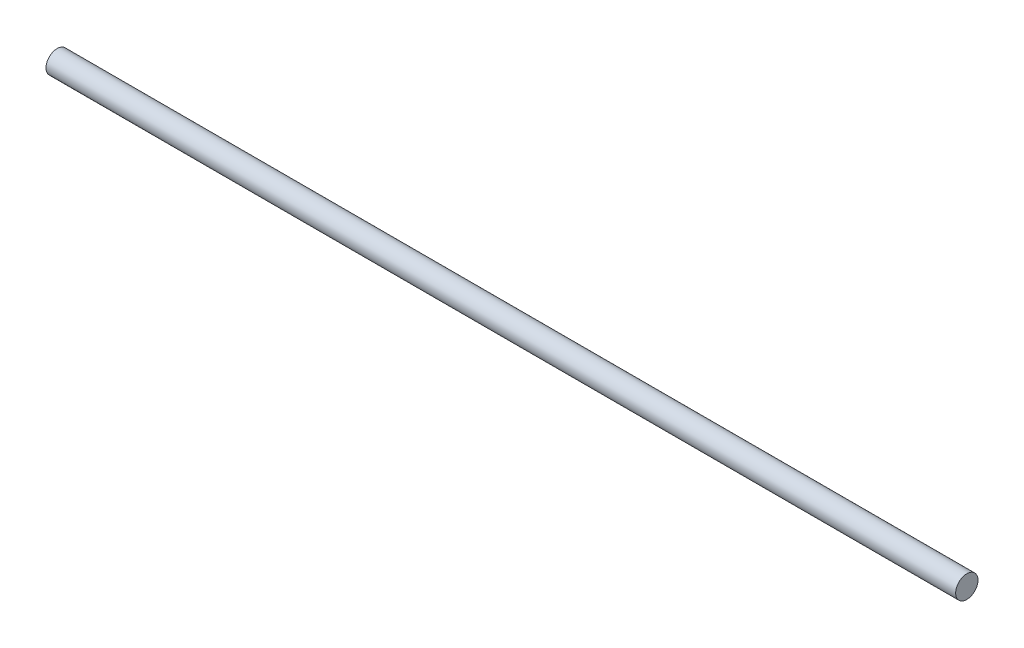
ISO-10303-21;
HEADER;
FILE_DESCRIPTION(('STEP AP214'),'2;1');
FILE_NAME('part.step','',(''),(''),'','','');
FILE_SCHEMA(('AUTOMOTIVE_DESIGN { 1 0 10303 214 1 1 1 1 }'));
ENDSEC;
DATA;
#1=APPLICATION_CONTEXT('core data for automotive mechanical design processes');
#2=APPLICATION_PROTOCOL_DEFINITION('international standard','automotive_design',2000,#1);
#3=PRODUCT_CONTEXT('',#1,'mechanical');
#4=PRODUCT('Part','Part','',(#3));
#5=PRODUCT_RELATED_PRODUCT_CATEGORY('part','',(#4));
#6=PRODUCT_DEFINITION_FORMATION('','',#4);
#7=PRODUCT_DEFINITION_CONTEXT('part definition',#1,'design');
#8=PRODUCT_DEFINITION('design','',#6,#7);
#9=PRODUCT_DEFINITION_SHAPE('','',#8);
#10=(LENGTH_UNIT() NAMED_UNIT(*) SI_UNIT(.MILLI.,.METRE.));
#11=(NAMED_UNIT(*) PLANE_ANGLE_UNIT() SI_UNIT($,.RADIAN.));
#12=(NAMED_UNIT(*) SI_UNIT($,.STERADIAN.) SOLID_ANGLE_UNIT());
#13=UNCERTAINTY_MEASURE_WITH_UNIT(LENGTH_MEASURE(1.E-05),#10,'distance_accuracy_value','');
#14=(GEOMETRIC_REPRESENTATION_CONTEXT(3) GLOBAL_UNCERTAINTY_ASSIGNED_CONTEXT((#13)) GLOBAL_UNIT_ASSIGNED_CONTEXT((#10,
#11,#12)) REPRESENTATION_CONTEXT('',''));
#15=CARTESIAN_POINT('',(0.,0.,0.));
#16=DIRECTION('',(0.,0.,1.));
#17=DIRECTION('',(1.,0.,0.));
#18=AXIS2_PLACEMENT_3D('',#15,#16,#17);
#19=CARTESIAN_POINT('',(60.,0.,0.));
#20=DIRECTION('',(1.,0.,0.));
#21=DIRECTION('',(0.,0.,-1.));
#22=AXIS2_PLACEMENT_3D('',#19,#20,#21);
#23=PLANE('',#22);
#24=CARTESIAN_POINT('',(60.,0.,0.));
#25=DIRECTION('',(1.,0.,0.));
#26=DIRECTION('',(0.,0.,-1.));
#27=AXIS2_PLACEMENT_3D('',#24,#25,#26);
#28=CIRCLE('',#27,1.475);
#29=CARTESIAN_POINT('',(60.,0.,-1.475));
#30=VERTEX_POINT('',#29);
#31=EDGE_CURVE('E18',#30,#30,#28,.F.);
#32=ORIENTED_EDGE('',*,*,#31,.F.);
#33=EDGE_LOOP('',(#32));
#34=FACE_BOUND('',#33,.T.);
#35=ADVANCED_FACE('F15',(#34),#23,.T.);
#36=CARTESIAN_POINT('',(-60.,0.,0.));
#37=DIRECTION('',(1.,0.,0.));
#38=DIRECTION('',(0.,0.,-1.));
#39=AXIS2_PLACEMENT_3D('',#36,#37,#38);
#40=PLANE('',#39);
#41=CARTESIAN_POINT('',(-60.,0.,0.));
#42=DIRECTION('',(1.,0.,0.));
#43=DIRECTION('',(0.,0.,-1.));
#44=AXIS2_PLACEMENT_3D('',#41,#42,#43);
#45=CIRCLE('',#44,1.475);
#46=CARTESIAN_POINT('',(-60.,0.,-1.475));
#47=VERTEX_POINT('',#46);
#48=EDGE_CURVE('E10',#47,#47,#45,.T.);
#49=ORIENTED_EDGE('',*,*,#48,.F.);
#50=EDGE_LOOP('',(#49));
#51=FACE_BOUND('',#50,.T.);
#52=ADVANCED_FACE('F30',(#51),#40,.F.);
#53=CARTESIAN_POINT('',(-60.,0.,0.));
#54=DIRECTION('',(1.,0.,0.));
#55=DIRECTION('',(0.,0.,-1.));
#56=AXIS2_PLACEMENT_3D('',#53,#54,#55);
#57=CYLINDRICAL_SURFACE('',#56,1.475);
#58=ORIENTED_EDGE('',*,*,#31,.T.);
#59=EDGE_LOOP('',(#58));
#60=FACE_BOUND('',#59,.T.);
#61=ORIENTED_EDGE('',*,*,#48,.T.);
#62=EDGE_LOOP('',(#61));
#63=FACE_BOUND('',#62,.T.);
#64=ADVANCED_FACE('F27',(#60,#63),#57,.T.);
#65=CLOSED_SHELL('',(#35,#52,#64));
#66=MANIFOLD_SOLID_BREP('B1',#65);
#67=ADVANCED_BREP_SHAPE_REPRESENTATION('',(#18,#66),#14);
#68=SHAPE_DEFINITION_REPRESENTATION(#9,#67);
ENDSEC;
END-ISO-10303-21;
